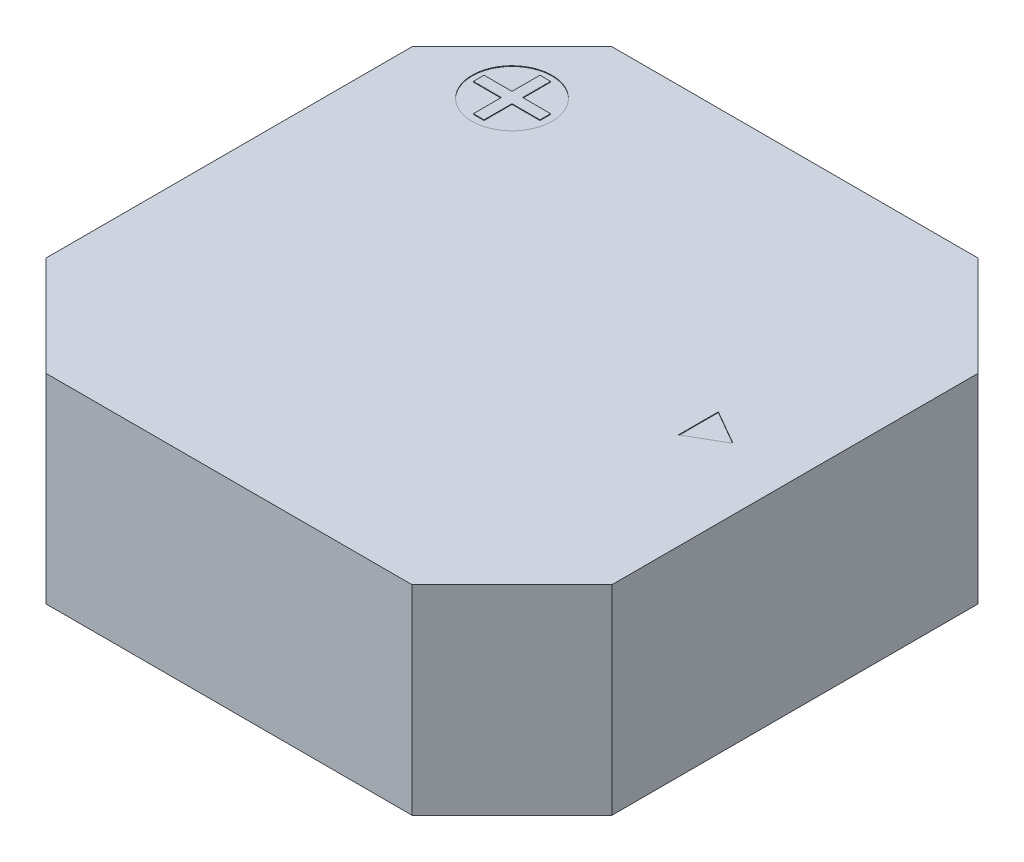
ISO-10303-21;
HEADER;
FILE_DESCRIPTION(('STEP AP214'),'2;1');
FILE_NAME('part.step','',(''),(''),'','','');
FILE_SCHEMA(('AUTOMOTIVE_DESIGN { 1 0 10303 214 1 1 1 1 }'));
ENDSEC;
DATA;
#1=APPLICATION_CONTEXT('core data for automotive mechanical design processes');
#2=APPLICATION_PROTOCOL_DEFINITION('international standard','automotive_design',2000,#1);
#3=PRODUCT_CONTEXT('',#1,'mechanical');
#4=PRODUCT('Part','Part','',(#3));
#5=PRODUCT_RELATED_PRODUCT_CATEGORY('part','',(#4));
#6=PRODUCT_DEFINITION_FORMATION('','',#4);
#7=PRODUCT_DEFINITION_CONTEXT('part definition',#1,'design');
#8=PRODUCT_DEFINITION('design','',#6,#7);
#9=PRODUCT_DEFINITION_SHAPE('','',#8);
#10=(LENGTH_UNIT() NAMED_UNIT(*) SI_UNIT(.MILLI.,.METRE.));
#11=(NAMED_UNIT(*) PLANE_ANGLE_UNIT() SI_UNIT($,.RADIAN.));
#12=(NAMED_UNIT(*) SI_UNIT($,.STERADIAN.) SOLID_ANGLE_UNIT());
#13=UNCERTAINTY_MEASURE_WITH_UNIT(LENGTH_MEASURE(1.E-05),#10,'distance_accuracy_value','');
#14=(GEOMETRIC_REPRESENTATION_CONTEXT(3) GLOBAL_UNCERTAINTY_ASSIGNED_CONTEXT((#13)) GLOBAL_UNIT_ASSIGNED_CONTEXT((#10,
#11,#12)) REPRESENTATION_CONTEXT('',''));
#15=CARTESIAN_POINT('',(0.,0.,0.));
#16=DIRECTION('',(0.,0.,1.));
#17=DIRECTION('',(1.,0.,0.));
#18=AXIS2_PLACEMENT_3D('',#15,#16,#17);
#19=CARTESIAN_POINT('',(-2.90842712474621,3.01,-3.32842712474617));
#20=DIRECTION('',(0.,0.,1.));
#21=DIRECTION('',(1.,0.,0.));
#22=AXIS2_PLACEMENT_3D('',#19,#20,#21);
#23=PLANE('',#22);
#24=DIRECTION('',(-1.,0.,0.));
#25=VECTOR('',#24,1.);
#26=CARTESIAN_POINT('',(-2.90842712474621,3.,-3.32842712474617));
#27=LINE('',#26,#25);
#28=CARTESIAN_POINT('',(-2.74842712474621,3.,-3.32842712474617));
#29=VERTEX_POINT('',#28);
#30=CARTESIAN_POINT('',(-2.90842712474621,3.,-3.32842712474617));
#31=VERTEX_POINT('',#30);
#32=EDGE_CURVE('E162',#29,#31,#27,.T.);
#33=ORIENTED_EDGE('',*,*,#32,.T.);
#34=DIRECTION('',(0.,-1.,0.));
#35=VECTOR('',#34,1.);
#36=CARTESIAN_POINT('',(-2.90842712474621,3.01,-3.32842712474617));
#37=LINE('',#36,#35);
#38=CARTESIAN_POINT('',(-2.90842712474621,3.01,-3.32842712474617));
#39=VERTEX_POINT('',#38);
#40=EDGE_CURVE('E12',#39,#31,#37,.T.);
#41=ORIENTED_EDGE('',*,*,#40,.F.);
#42=DIRECTION('',(-1.,0.,0.));
#43=VECTOR('',#42,1.);
#44=CARTESIAN_POINT('',(-2.90842712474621,3.01,-3.32842712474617));
#45=LINE('',#44,#43);
#46=CARTESIAN_POINT('',(-2.74842712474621,3.01,-3.32842712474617));
#47=VERTEX_POINT('',#46);
#48=EDGE_CURVE('E184',#47,#39,#45,.T.);
#49=ORIENTED_EDGE('',*,*,#48,.F.);
#50=DIRECTION('',(0.,-1.,0.));
#51=VECTOR('',#50,1.);
#52=CARTESIAN_POINT('',(-2.74842712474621,3.01,-3.32842712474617));
#53=LINE('',#52,#51);
#54=EDGE_CURVE('E158',#47,#29,#53,.T.);
#55=ORIENTED_EDGE('',*,*,#54,.T.);
#56=EDGE_LOOP('',(#33,#41,#49,#55));
#57=FACE_BOUND('',#56,.T.);
#58=ADVANCED_FACE('F42',(#57),#23,.F.);
#59=CARTESIAN_POINT('',(-2.90842712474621,3.01,-3.32842712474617));
#60=DIRECTION('',(1.,0.,0.));
#61=DIRECTION('',(0.,0.,-1.));
#62=AXIS2_PLACEMENT_3D('',#59,#60,#61);
#63=PLANE('',#62);
#64=DIRECTION('',(0.,0.,1.));
#65=VECTOR('',#64,1.);
#66=CARTESIAN_POINT('',(-2.90842712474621,3.,-3.32842712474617));
#67=LINE('',#66,#65);
#68=CARTESIAN_POINT('',(-2.90842712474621,3.,-2.90842712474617));
#69=VERTEX_POINT('',#68);
#70=EDGE_CURVE('E165',#31,#69,#67,.T.);
#71=ORIENTED_EDGE('',*,*,#70,.T.);
#72=DIRECTION('',(0.,-1.,0.));
#73=VECTOR('',#72,1.);
#74=CARTESIAN_POINT('',(-2.90842712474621,3.01,-2.90842712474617));
#75=LINE('',#74,#73);
#76=CARTESIAN_POINT('',(-2.90842712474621,3.01,-2.90842712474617));
#77=VERTEX_POINT('',#76);
#78=EDGE_CURVE('E50',#77,#69,#75,.T.);
#79=ORIENTED_EDGE('',*,*,#78,.F.);
#80=DIRECTION('',(0.,0.,1.));
#81=VECTOR('',#80,1.);
#82=CARTESIAN_POINT('',(-2.90842712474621,3.01,-3.32842712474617));
#83=LINE('',#82,#81);
#84=EDGE_CURVE('E113',#39,#77,#83,.T.);
#85=ORIENTED_EDGE('',*,*,#84,.F.);
#86=ORIENTED_EDGE('',*,*,#40,.T.);
#87=EDGE_LOOP('',(#71,#79,#85,#86));
#88=FACE_BOUND('',#87,.T.);
#89=ADVANCED_FACE('F262',(#88),#63,.F.);
#90=CARTESIAN_POINT('',(-2.90842712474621,3.01,-2.90842712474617));
#91=DIRECTION('',(0.,0.,1.));
#92=DIRECTION('',(1.,0.,0.));
#93=AXIS2_PLACEMENT_3D('',#90,#91,#92);
#94=PLANE('',#93);
#95=DIRECTION('',(-1.,0.,0.));
#96=VECTOR('',#95,1.);
#97=CARTESIAN_POINT('',(-2.90842712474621,3.,-2.90842712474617));
#98=LINE('',#97,#96);
#99=CARTESIAN_POINT('',(-3.32842712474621,3.,-2.90842712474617));
#100=VERTEX_POINT('',#99);
#101=EDGE_CURVE('E167',#69,#100,#98,.T.);
#102=ORIENTED_EDGE('',*,*,#101,.T.);
#103=DIRECTION('',(0.,-1.,0.));
#104=VECTOR('',#103,1.);
#105=CARTESIAN_POINT('',(-3.32842712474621,3.01,-2.90842712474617));
#106=LINE('',#105,#104);
#107=CARTESIAN_POINT('',(-3.32842712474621,3.01,-2.90842712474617));
#108=VERTEX_POINT('',#107);
#109=EDGE_CURVE('E203',#108,#100,#106,.T.);
#110=ORIENTED_EDGE('',*,*,#109,.F.);
#111=DIRECTION('',(-1.,0.,0.));
#112=VECTOR('',#111,1.);
#113=CARTESIAN_POINT('',(-2.90842712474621,3.01,-2.90842712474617));
#114=LINE('',#113,#112);
#115=EDGE_CURVE('E211',#77,#108,#114,.T.);
#116=ORIENTED_EDGE('',*,*,#115,.F.);
#117=ORIENTED_EDGE('',*,*,#78,.T.);
#118=EDGE_LOOP('',(#102,#110,#116,#117));
#119=FACE_BOUND('',#118,.T.);
#120=ADVANCED_FACE('F209',(#119),#94,.F.);
#121=CARTESIAN_POINT('',(-3.32842712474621,3.01,-2.90842712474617));
#122=DIRECTION('',(1.,0.,0.));
#123=DIRECTION('',(0.,0.,-1.));
#124=AXIS2_PLACEMENT_3D('',#121,#122,#123);
#125=PLANE('',#124);
#126=DIRECTION('',(0.,0.,1.));
#127=VECTOR('',#126,1.);
#128=CARTESIAN_POINT('',(-3.32842712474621,3.,-2.90842712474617));
#129=LINE('',#128,#127);
#130=CARTESIAN_POINT('',(-3.32842712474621,3.,-2.74842712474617));
#131=VERTEX_POINT('',#130);
#132=EDGE_CURVE('E169',#100,#131,#129,.T.);
#133=ORIENTED_EDGE('',*,*,#132,.T.);
#134=DIRECTION('',(0.,-1.,0.));
#135=VECTOR('',#134,1.);
#136=CARTESIAN_POINT('',(-3.32842712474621,3.01,-2.74842712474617));
#137=LINE('',#136,#135);
#138=CARTESIAN_POINT('',(-3.32842712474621,3.01,-2.74842712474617));
#139=VERTEX_POINT('',#138);
#140=EDGE_CURVE('E200',#139,#131,#137,.T.);
#141=ORIENTED_EDGE('',*,*,#140,.F.);
#142=DIRECTION('',(0.,0.,1.));
#143=VECTOR('',#142,1.);
#144=CARTESIAN_POINT('',(-3.32842712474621,3.01,-2.90842712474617));
#145=LINE('',#144,#143);
#146=EDGE_CURVE('E229',#108,#139,#145,.T.);
#147=ORIENTED_EDGE('',*,*,#146,.F.);
#148=ORIENTED_EDGE('',*,*,#109,.T.);
#149=EDGE_LOOP('',(#133,#141,#147,#148));
#150=FACE_BOUND('',#149,.T.);
#151=ADVANCED_FACE('F220',(#150),#125,.F.);
#152=CARTESIAN_POINT('',(-3.32842712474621,3.01,-2.74842712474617));
#153=DIRECTION('',(0.,0.,-1.));
#154=DIRECTION('',(-1.,0.,0.));
#155=AXIS2_PLACEMENT_3D('',#152,#153,#154);
#156=PLANE('',#155);
#157=DIRECTION('',(1.,0.,0.));
#158=VECTOR('',#157,1.);
#159=CARTESIAN_POINT('',(-3.32842712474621,3.,-2.74842712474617));
#160=LINE('',#159,#158);
#161=CARTESIAN_POINT('',(-2.90842712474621,3.,-2.74842712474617));
#162=VERTEX_POINT('',#161);
#163=EDGE_CURVE('E171',#131,#162,#160,.T.);
#164=ORIENTED_EDGE('',*,*,#163,.T.);
#165=DIRECTION('',(0.,-1.,0.));
#166=VECTOR('',#165,1.);
#167=CARTESIAN_POINT('',(-2.90842712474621,3.01,-2.74842712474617));
#168=LINE('',#167,#166);
#169=CARTESIAN_POINT('',(-2.90842712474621,3.01,-2.74842712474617));
#170=VERTEX_POINT('',#169);
#171=EDGE_CURVE('E197',#170,#162,#168,.T.);
#172=ORIENTED_EDGE('',*,*,#171,.F.);
#173=DIRECTION('',(1.,0.,0.));
#174=VECTOR('',#173,1.);
#175=CARTESIAN_POINT('',(-3.32842712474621,3.01,-2.74842712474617));
#176=LINE('',#175,#174);
#177=EDGE_CURVE('E226',#139,#170,#176,.T.);
#178=ORIENTED_EDGE('',*,*,#177,.F.);
#179=ORIENTED_EDGE('',*,*,#140,.T.);
#180=EDGE_LOOP('',(#164,#172,#178,#179));
#181=FACE_BOUND('',#180,.T.);
#182=ADVANCED_FACE('F224',(#181),#156,.F.);
#183=CARTESIAN_POINT('',(-2.90842712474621,3.01,-2.74842712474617));
#184=DIRECTION('',(1.,0.,0.));
#185=DIRECTION('',(0.,0.,-1.));
#186=AXIS2_PLACEMENT_3D('',#183,#184,#185);
#187=PLANE('',#186);
#188=DIRECTION('',(0.,0.,1.));
#189=VECTOR('',#188,1.);
#190=CARTESIAN_POINT('',(-2.90842712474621,3.,-2.74842712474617));
#191=LINE('',#190,#189);
#192=CARTESIAN_POINT('',(-2.90842712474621,3.,-2.32842712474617));
#193=VERTEX_POINT('',#192);
#194=EDGE_CURVE('E173',#162,#193,#191,.T.);
#195=ORIENTED_EDGE('',*,*,#194,.T.);
#196=DIRECTION('',(0.,-1.,0.));
#197=VECTOR('',#196,1.);
#198=CARTESIAN_POINT('',(-2.90842712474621,3.01,-2.32842712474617));
#199=LINE('',#198,#197);
#200=CARTESIAN_POINT('',(-2.90842712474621,3.01,-2.32842712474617));
#201=VERTEX_POINT('',#200);
#202=EDGE_CURVE('E194',#201,#193,#199,.T.);
#203=ORIENTED_EDGE('',*,*,#202,.F.);
#204=DIRECTION('',(0.,0.,1.));
#205=VECTOR('',#204,1.);
#206=CARTESIAN_POINT('',(-2.90842712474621,3.01,-2.74842712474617));
#207=LINE('',#206,#205);
#208=EDGE_CURVE('E228',#170,#201,#207,.T.);
#209=ORIENTED_EDGE('',*,*,#208,.F.);
#210=ORIENTED_EDGE('',*,*,#171,.T.);
#211=EDGE_LOOP('',(#195,#203,#209,#210));
#212=FACE_BOUND('',#211,.T.);
#213=ADVANCED_FACE('F275',(#212),#187,.F.);
#214=CARTESIAN_POINT('',(-2.90842712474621,3.01,-2.32842712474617));
#215=DIRECTION('',(0.,0.,-1.));
#216=DIRECTION('',(-1.,0.,0.));
#217=AXIS2_PLACEMENT_3D('',#214,#215,#216);
#218=PLANE('',#217);
#219=DIRECTION('',(1.,0.,0.));
#220=VECTOR('',#219,1.);
#221=CARTESIAN_POINT('',(-2.90842712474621,3.,-2.32842712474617));
#222=LINE('',#221,#220);
#223=CARTESIAN_POINT('',(-2.74842712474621,3.,-2.32842712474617));
#224=VERTEX_POINT('',#223);
#225=EDGE_CURVE('E175',#193,#224,#222,.T.);
#226=ORIENTED_EDGE('',*,*,#225,.T.);
#227=DIRECTION('',(0.,-1.,0.));
#228=VECTOR('',#227,1.);
#229=CARTESIAN_POINT('',(-2.74842712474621,3.01,-2.32842712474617));
#230=LINE('',#229,#228);
#231=CARTESIAN_POINT('',(-2.74842712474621,3.01,-2.32842712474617));
#232=VERTEX_POINT('',#231);
#233=EDGE_CURVE('E191',#232,#224,#230,.T.);
#234=ORIENTED_EDGE('',*,*,#233,.F.);
#235=DIRECTION('',(1.,0.,0.));
#236=VECTOR('',#235,1.);
#237=CARTESIAN_POINT('',(-2.90842712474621,3.01,-2.32842712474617));
#238=LINE('',#237,#236);
#239=EDGE_CURVE('E231',#201,#232,#238,.T.);
#240=ORIENTED_EDGE('',*,*,#239,.F.);
#241=ORIENTED_EDGE('',*,*,#202,.T.);
#242=EDGE_LOOP('',(#226,#234,#240,#241));
#243=FACE_BOUND('',#242,.T.);
#244=ADVANCED_FACE('F278',(#243),#218,.F.);
#245=CARTESIAN_POINT('',(-2.74842712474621,3.01,-2.74842712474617));
#246=DIRECTION('',(-1.,0.,0.));
#247=DIRECTION('',(0.,0.,1.));
#248=AXIS2_PLACEMENT_3D('',#245,#246,#247);
#249=PLANE('',#248);
#250=DIRECTION('',(0.,0.,-1.));
#251=VECTOR('',#250,1.);
#252=CARTESIAN_POINT('',(-2.74842712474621,3.,-2.74842712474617));
#253=LINE('',#252,#251);
#254=CARTESIAN_POINT('',(-2.74842712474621,3.,-2.74842712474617));
#255=VERTEX_POINT('',#254);
#256=EDGE_CURVE('E177',#224,#255,#253,.T.);
#257=ORIENTED_EDGE('',*,*,#256,.T.);
#258=DIRECTION('',(0.,-1.,0.));
#259=VECTOR('',#258,1.);
#260=CARTESIAN_POINT('',(-2.74842712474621,3.01,-2.74842712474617));
#261=LINE('',#260,#259);
#262=CARTESIAN_POINT('',(-2.74842712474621,3.01,-2.74842712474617));
#263=VERTEX_POINT('',#262);
#264=EDGE_CURVE('E188',#263,#255,#261,.T.);
#265=ORIENTED_EDGE('',*,*,#264,.F.);
#266=DIRECTION('',(0.,0.,-1.));
#267=VECTOR('',#266,1.);
#268=CARTESIAN_POINT('',(-2.74842712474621,3.01,-2.74842712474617));
#269=LINE('',#268,#267);
#270=EDGE_CURVE('E237',#232,#263,#269,.T.);
#271=ORIENTED_EDGE('',*,*,#270,.F.);
#272=ORIENTED_EDGE('',*,*,#233,.T.);
#273=EDGE_LOOP('',(#257,#265,#271,#272));
#274=FACE_BOUND('',#273,.T.);
#275=ADVANCED_FACE('F243',(#274),#249,.F.);
#276=CARTESIAN_POINT('',(-2.32842712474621,3.01,-2.74842712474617));
#277=DIRECTION('',(0.,0.,-1.));
#278=DIRECTION('',(-1.,0.,0.));
#279=AXIS2_PLACEMENT_3D('',#276,#277,#278);
#280=PLANE('',#279);
#281=DIRECTION('',(1.,0.,0.));
#282=VECTOR('',#281,1.);
#283=CARTESIAN_POINT('',(-2.32842712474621,3.,-2.74842712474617));
#284=LINE('',#283,#282);
#285=CARTESIAN_POINT('',(-2.32842712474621,3.,-2.74842712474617));
#286=VERTEX_POINT('',#285);
#287=EDGE_CURVE('E179',#255,#286,#284,.T.);
#288=ORIENTED_EDGE('',*,*,#287,.T.);
#289=DIRECTION('',(0.,-1.,0.));
#290=VECTOR('',#289,1.);
#291=CARTESIAN_POINT('',(-2.32842712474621,3.01,-2.74842712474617));
#292=LINE('',#291,#290);
#293=CARTESIAN_POINT('',(-2.32842712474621,3.01,-2.74842712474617));
#294=VERTEX_POINT('',#293);
#295=EDGE_CURVE('E153',#294,#286,#292,.T.);
#296=ORIENTED_EDGE('',*,*,#295,.F.);
#297=DIRECTION('',(1.,0.,0.));
#298=VECTOR('',#297,1.);
#299=CARTESIAN_POINT('',(-2.32842712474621,3.01,-2.74842712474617));
#300=LINE('',#299,#298);
#301=EDGE_CURVE('E144',#263,#294,#300,.T.);
#302=ORIENTED_EDGE('',*,*,#301,.F.);
#303=ORIENTED_EDGE('',*,*,#264,.T.);
#304=EDGE_LOOP('',(#288,#296,#302,#303));
#305=FACE_BOUND('',#304,.T.);
#306=ADVANCED_FACE('F247',(#305),#280,.F.);
#307=CARTESIAN_POINT('',(-2.32842712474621,3.01,-2.90842712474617));
#308=DIRECTION('',(-1.,0.,0.));
#309=DIRECTION('',(0.,0.,1.));
#310=AXIS2_PLACEMENT_3D('',#307,#308,#309);
#311=PLANE('',#310);
#312=DIRECTION('',(0.,0.,-1.));
#313=VECTOR('',#312,1.);
#314=CARTESIAN_POINT('',(-2.32842712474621,3.,-2.90842712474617));
#315=LINE('',#314,#313);
#316=CARTESIAN_POINT('',(-2.32842712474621,3.,-2.90842712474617));
#317=VERTEX_POINT('',#316);
#318=EDGE_CURVE('E152',#286,#317,#315,.T.);
#319=ORIENTED_EDGE('',*,*,#318,.T.);
#320=DIRECTION('',(0.,-1.,0.));
#321=VECTOR('',#320,1.);
#322=CARTESIAN_POINT('',(-2.32842712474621,3.01,-2.90842712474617));
#323=LINE('',#322,#321);
#324=CARTESIAN_POINT('',(-2.32842712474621,3.01,-2.90842712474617));
#325=VERTEX_POINT('',#324);
#326=EDGE_CURVE('E149',#325,#317,#323,.T.);
#327=ORIENTED_EDGE('',*,*,#326,.F.);
#328=DIRECTION('',(0.,0.,-1.));
#329=VECTOR('',#328,1.);
#330=CARTESIAN_POINT('',(-2.32842712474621,3.01,-2.90842712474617));
#331=LINE('',#330,#329);
#332=EDGE_CURVE('E138',#294,#325,#331,.T.);
#333=ORIENTED_EDGE('',*,*,#332,.F.);
#334=ORIENTED_EDGE('',*,*,#295,.T.);
#335=EDGE_LOOP('',(#319,#327,#333,#334));
#336=FACE_BOUND('',#335,.T.);
#337=ADVANCED_FACE('F150',(#336),#311,.F.);
#338=CARTESIAN_POINT('',(-2.74842712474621,3.01,-2.90842712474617));
#339=DIRECTION('',(0.,0.,1.));
#340=DIRECTION('',(1.,0.,0.));
#341=AXIS2_PLACEMENT_3D('',#338,#339,#340);
#342=PLANE('',#341);
#343=DIRECTION('',(-1.,0.,0.));
#344=VECTOR('',#343,1.);
#345=CARTESIAN_POINT('',(-2.74842712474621,3.,-2.90842712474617));
#346=LINE('',#345,#344);
#347=CARTESIAN_POINT('',(-2.74842712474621,3.,-2.90842712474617));
#348=VERTEX_POINT('',#347);
#349=EDGE_CURVE('E99',#317,#348,#346,.T.);
#350=ORIENTED_EDGE('',*,*,#349,.T.);
#351=DIRECTION('',(0.,-1.,0.));
#352=VECTOR('',#351,1.);
#353=CARTESIAN_POINT('',(-2.74842712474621,3.01,-2.90842712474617));
#354=LINE('',#353,#352);
#355=CARTESIAN_POINT('',(-2.74842712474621,3.01,-2.90842712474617));
#356=VERTEX_POINT('',#355);
#357=EDGE_CURVE('E154',#356,#348,#354,.T.);
#358=ORIENTED_EDGE('',*,*,#357,.F.);
#359=DIRECTION('',(-1.,0.,0.));
#360=VECTOR('',#359,1.);
#361=CARTESIAN_POINT('',(-2.74842712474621,3.01,-2.90842712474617));
#362=LINE('',#361,#360);
#363=EDGE_CURVE('E142',#325,#356,#362,.T.);
#364=ORIENTED_EDGE('',*,*,#363,.F.);
#365=ORIENTED_EDGE('',*,*,#326,.T.);
#366=EDGE_LOOP('',(#350,#358,#364,#365));
#367=FACE_BOUND('',#366,.T.);
#368=ADVANCED_FACE('F156',(#367),#342,.F.);
#369=CARTESIAN_POINT('',(-2.74842712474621,3.01,-3.32842712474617));
#370=DIRECTION('',(-1.,0.,0.));
#371=DIRECTION('',(0.,0.,1.));
#372=AXIS2_PLACEMENT_3D('',#369,#370,#371);
#373=PLANE('',#372);
#374=DIRECTION('',(0.,0.,-1.));
#375=VECTOR('',#374,1.);
#376=CARTESIAN_POINT('',(-2.74842712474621,3.,-3.32842712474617));
#377=LINE('',#376,#375);
#378=EDGE_CURVE('E105',#348,#29,#377,.T.);
#379=ORIENTED_EDGE('',*,*,#378,.T.);
#380=ORIENTED_EDGE('',*,*,#54,.F.);
#381=DIRECTION('',(0.,0.,-1.));
#382=VECTOR('',#381,1.);
#383=CARTESIAN_POINT('',(-2.74842712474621,3.01,-3.32842712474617));
#384=LINE('',#383,#382);
#385=EDGE_CURVE('E58',#356,#47,#384,.T.);
#386=ORIENTED_EDGE('',*,*,#385,.F.);
#387=ORIENTED_EDGE('',*,*,#357,.T.);
#388=EDGE_LOOP('',(#379,#380,#386,#387));
#389=FACE_BOUND('',#388,.T.);
#390=ADVANCED_FACE('F251',(#389),#373,.F.);
#391=CARTESIAN_POINT('',(0.,3.01,0.));
#392=DIRECTION('',(0.,-1.,0.));
#393=DIRECTION('',(0.,0.,-1.));
#394=AXIS2_PLACEMENT_3D('',#391,#392,#393);
#395=PLANE('',#394);
#396=ORIENTED_EDGE('',*,*,#48,.T.);
#397=ORIENTED_EDGE('',*,*,#84,.T.);
#398=ORIENTED_EDGE('',*,*,#115,.T.);
#399=ORIENTED_EDGE('',*,*,#146,.T.);
#400=ORIENTED_EDGE('',*,*,#177,.T.);
#401=ORIENTED_EDGE('',*,*,#208,.T.);
#402=ORIENTED_EDGE('',*,*,#239,.T.);
#403=ORIENTED_EDGE('',*,*,#270,.T.);
#404=ORIENTED_EDGE('',*,*,#301,.T.);
#405=ORIENTED_EDGE('',*,*,#332,.T.);
#406=ORIENTED_EDGE('',*,*,#363,.T.);
#407=ORIENTED_EDGE('',*,*,#385,.T.);
#408=EDGE_LOOP('',(#396,#397,#398,#399,#400,#401,#402,#403,#404,#405,#406,#407));
#409=FACE_BOUND('',#408,.T.);
#410=ADVANCED_FACE('F140',(#409),#395,.F.);
#411=CARTESIAN_POINT('',(0.,3.,0.));
#412=DIRECTION('',(0.,-1.,0.));
#413=DIRECTION('',(0.,0.,-1.));
#414=AXIS2_PLACEMENT_3D('',#411,#412,#413);
#415=PLANE('',#414);
#416=ORIENTED_EDGE('',*,*,#32,.F.);
#417=ORIENTED_EDGE('',*,*,#378,.F.);
#418=ORIENTED_EDGE('',*,*,#349,.F.);
#419=ORIENTED_EDGE('',*,*,#318,.F.);
#420=ORIENTED_EDGE('',*,*,#287,.F.);
#421=ORIENTED_EDGE('',*,*,#256,.F.);
#422=ORIENTED_EDGE('',*,*,#225,.F.);
#423=ORIENTED_EDGE('',*,*,#194,.F.);
#424=ORIENTED_EDGE('',*,*,#163,.F.);
#425=ORIENTED_EDGE('',*,*,#132,.F.);
#426=ORIENTED_EDGE('',*,*,#101,.F.);
#427=ORIENTED_EDGE('',*,*,#70,.F.);
#428=EDGE_LOOP('',(#416,#417,#418,#419,#420,#421,#422,#423,#424,#425,#426,#427));
#429=FACE_BOUND('',#428,.T.);
#430=ADVANCED_FACE('F215',(#429),#415,.T.);
#431=CLOSED_SHELL('',(#58,#89,#120,#151,#182,#213,#244,#275,#306,#337,#368,#390,#410,#430));
#432=MANIFOLD_SOLID_BREP('B2',#431);
#433=CARTESIAN_POINT('',(-4.25,3.,2.75));
#434=DIRECTION('',(1.,0.,0.));
#435=DIRECTION('',(0.,0.,-1.));
#436=AXIS2_PLACEMENT_3D('',#433,#434,#435);
#437=PLANE('',#436);
#438=DIRECTION('',(0.,0.,1.));
#439=VECTOR('',#438,1.);
#440=CARTESIAN_POINT('',(-4.25,0.,2.75));
#441=LINE('',#440,#439);
#442=CARTESIAN_POINT('',(-4.25,0.,-2.75));
#443=VERTEX_POINT('',#442);
#444=CARTESIAN_POINT('',(-4.25,0.,2.75));
#445=VERTEX_POINT('',#444);
#446=EDGE_CURVE('E481',#443,#445,#441,.T.);
#447=ORIENTED_EDGE('',*,*,#446,.T.);
#448=DIRECTION('',(0.,-1.,0.));
#449=VECTOR('',#448,1.);
#450=CARTESIAN_POINT('',(-4.25,3.,2.75));
#451=LINE('',#450,#449);
#452=CARTESIAN_POINT('',(-4.25,3.,2.75));
#453=VERTEX_POINT('',#452);
#454=EDGE_CURVE('E40',#453,#445,#451,.T.);
#455=ORIENTED_EDGE('',*,*,#454,.F.);
#456=DIRECTION('',(0.,0.,1.));
#457=VECTOR('',#456,1.);
#458=CARTESIAN_POINT('',(-4.25,3.,2.75));
#459=LINE('',#458,#457);
#460=CARTESIAN_POINT('',(-4.25,3.,-2.75));
#461=VERTEX_POINT('',#460);
#462=EDGE_CURVE('E497',#461,#453,#459,.T.);
#463=ORIENTED_EDGE('',*,*,#462,.F.);
#464=DIRECTION('',(0.,-1.,0.));
#465=VECTOR('',#464,1.);
#466=CARTESIAN_POINT('',(-4.25,3.,-2.75));
#467=LINE('',#466,#465);
#468=EDGE_CURVE('E477',#461,#443,#467,.T.);
#469=ORIENTED_EDGE('',*,*,#468,.T.);
#470=EDGE_LOOP('',(#447,#455,#463,#469));
#471=FACE_BOUND('',#470,.T.);
#472=ADVANCED_FACE('F373',(#471),#437,.F.);
#473=CARTESIAN_POINT('',(-4.25,3.,2.75));
#474=DIRECTION('',(0.707106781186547,0.,-0.707106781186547));
#475=DIRECTION('',(-0.707106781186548,0.,-0.707106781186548));
#476=AXIS2_PLACEMENT_3D('',#473,#474,#475);
#477=PLANE('',#476);
#478=DIRECTION('',(0.707106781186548,0.,0.707106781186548));
#479=VECTOR('',#478,1.);
#480=CARTESIAN_POINT('',(-4.25,0.,2.75));
#481=LINE('',#480,#479);
#482=CARTESIAN_POINT('',(-2.75,0.,4.25));
#483=VERTEX_POINT('',#482);
#484=EDGE_CURVE('E484',#445,#483,#481,.T.);
#485=ORIENTED_EDGE('',*,*,#484,.T.);
#486=DIRECTION('',(0.,-1.,0.));
#487=VECTOR('',#486,1.);
#488=CARTESIAN_POINT('',(-2.75,3.,4.25));
#489=LINE('',#488,#487);
#490=CARTESIAN_POINT('',(-2.75,3.,4.25));
#491=VERTEX_POINT('',#490);
#492=EDGE_CURVE('E380',#491,#483,#489,.T.);
#493=ORIENTED_EDGE('',*,*,#492,.F.);
#494=DIRECTION('',(0.707106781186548,0.,0.707106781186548));
#495=VECTOR('',#494,1.);
#496=CARTESIAN_POINT('',(-4.25,3.,2.75));
#497=LINE('',#496,#495);
#498=EDGE_CURVE('E437',#453,#491,#497,.T.);
#499=ORIENTED_EDGE('',*,*,#498,.F.);
#500=ORIENTED_EDGE('',*,*,#454,.T.);
#501=EDGE_LOOP('',(#485,#493,#499,#500));
#502=FACE_BOUND('',#501,.T.);
#503=ADVANCED_FACE('F601',(#502),#477,.F.);
#504=CARTESIAN_POINT('',(-2.75,3.,4.25));
#505=DIRECTION('',(0.,0.,-1.));
#506=DIRECTION('',(-1.,0.,0.));
#507=AXIS2_PLACEMENT_3D('',#504,#505,#506);
#508=PLANE('',#507);
#509=DIRECTION('',(1.,0.,0.));
#510=VECTOR('',#509,1.);
#511=CARTESIAN_POINT('',(-2.75,0.,4.25));
#512=LINE('',#511,#510);
#513=CARTESIAN_POINT('',(2.75,0.,4.25));
#514=VERTEX_POINT('',#513);
#515=EDGE_CURVE('E487',#483,#514,#512,.T.);
#516=ORIENTED_EDGE('',*,*,#515,.T.);
#517=DIRECTION('',(0.,-1.,0.));
#518=VECTOR('',#517,1.);
#519=CARTESIAN_POINT('',(2.75,3.,4.25));
#520=LINE('',#519,#518);
#521=CARTESIAN_POINT('',(2.75,3.,4.25));
#522=VERTEX_POINT('',#521);
#523=EDGE_CURVE('E504',#522,#514,#520,.T.);
#524=ORIENTED_EDGE('',*,*,#523,.F.);
#525=DIRECTION('',(1.,0.,0.));
#526=VECTOR('',#525,1.);
#527=CARTESIAN_POINT('',(-2.75,3.,4.25));
#528=LINE('',#527,#526);
#529=EDGE_CURVE('E512',#491,#522,#528,.T.);
#530=ORIENTED_EDGE('',*,*,#529,.F.);
#531=ORIENTED_EDGE('',*,*,#492,.T.);
#532=EDGE_LOOP('',(#516,#524,#530,#531));
#533=FACE_BOUND('',#532,.T.);
#534=ADVANCED_FACE('F510',(#533),#508,.F.);
#535=CARTESIAN_POINT('',(2.75,3.,4.25));
#536=DIRECTION('',(-0.707106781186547,0.,-0.707106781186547));
#537=DIRECTION('',(-0.707106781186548,0.,0.707106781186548));
#538=AXIS2_PLACEMENT_3D('',#535,#536,#537);
#539=PLANE('',#538);
#540=DIRECTION('',(0.707106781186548,0.,-0.707106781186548));
#541=VECTOR('',#540,1.);
#542=CARTESIAN_POINT('',(2.75,0.,4.25));
#543=LINE('',#542,#541);
#544=CARTESIAN_POINT('',(4.25,0.,2.75));
#545=VERTEX_POINT('',#544);
#546=EDGE_CURVE('E489',#514,#545,#543,.T.);
#547=ORIENTED_EDGE('',*,*,#546,.T.);
#548=DIRECTION('',(0.,-1.,0.));
#549=VECTOR('',#548,1.);
#550=CARTESIAN_POINT('',(4.25,3.,2.75));
#551=LINE('',#550,#549);
#552=CARTESIAN_POINT('',(4.25,3.,2.75));
#553=VERTEX_POINT('',#552);
#554=EDGE_CURVE('E501',#553,#545,#551,.T.);
#555=ORIENTED_EDGE('',*,*,#554,.F.);
#556=DIRECTION('',(0.707106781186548,0.,-0.707106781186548));
#557=VECTOR('',#556,1.);
#558=CARTESIAN_POINT('',(2.75,3.,4.25));
#559=LINE('',#558,#557);
#560=EDGE_CURVE('E524',#522,#553,#559,.T.);
#561=ORIENTED_EDGE('',*,*,#560,.F.);
#562=ORIENTED_EDGE('',*,*,#523,.T.);
#563=EDGE_LOOP('',(#547,#555,#561,#562));
#564=FACE_BOUND('',#563,.T.);
#565=ADVANCED_FACE('F520',(#564),#539,.F.);
#566=CARTESIAN_POINT('',(4.25,3.,2.75));
#567=DIRECTION('',(-1.,0.,0.));
#568=DIRECTION('',(0.,0.,1.));
#569=AXIS2_PLACEMENT_3D('',#566,#567,#568);
#570=PLANE('',#569);
#571=DIRECTION('',(0.,0.,-1.));
#572=VECTOR('',#571,1.);
#573=CARTESIAN_POINT('',(4.25,0.,2.75));
#574=LINE('',#573,#572);
#575=CARTESIAN_POINT('',(4.25,0.,-2.75));
#576=VERTEX_POINT('',#575);
#577=EDGE_CURVE('E491',#545,#576,#574,.T.);
#578=ORIENTED_EDGE('',*,*,#577,.T.);
#579=DIRECTION('',(0.,-1.,0.));
#580=VECTOR('',#579,1.);
#581=CARTESIAN_POINT('',(4.25,3.,-2.75));
#582=LINE('',#581,#580);
#583=CARTESIAN_POINT('',(4.25,3.,-2.75));
#584=VERTEX_POINT('',#583);
#585=EDGE_CURVE('E472',#584,#576,#582,.T.);
#586=ORIENTED_EDGE('',*,*,#585,.F.);
#587=DIRECTION('',(0.,0.,-1.));
#588=VECTOR('',#587,1.);
#589=CARTESIAN_POINT('',(4.25,3.,2.75));
#590=LINE('',#589,#588);
#591=EDGE_CURVE('E460',#553,#584,#590,.T.);
#592=ORIENTED_EDGE('',*,*,#591,.F.);
#593=ORIENTED_EDGE('',*,*,#554,.T.);
#594=EDGE_LOOP('',(#578,#586,#592,#593));
#595=FACE_BOUND('',#594,.T.);
#596=ADVANCED_FACE('F523',(#595),#570,.F.);
#597=CARTESIAN_POINT('',(2.75,3.,-4.25));
#598=DIRECTION('',(-0.707106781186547,0.,0.707106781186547));
#599=DIRECTION('',(0.707106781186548,0.,0.707106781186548));
#600=AXIS2_PLACEMENT_3D('',#597,#598,#599);
#601=PLANE('',#600);
#602=DIRECTION('',(-0.707106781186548,0.,-0.707106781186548));
#603=VECTOR('',#602,1.);
#604=CARTESIAN_POINT('',(2.75,0.,-4.25));
#605=LINE('',#604,#603);
#606=CARTESIAN_POINT('',(2.75,0.,-4.25));
#607=VERTEX_POINT('',#606);
#608=EDGE_CURVE('E469',#576,#607,#605,.T.);
#609=ORIENTED_EDGE('',*,*,#608,.T.);
#610=DIRECTION('',(0.,-1.,0.));
#611=VECTOR('',#610,1.);
#612=CARTESIAN_POINT('',(2.75,3.,-4.25));
#613=LINE('',#612,#611);
#614=CARTESIAN_POINT('',(2.75,3.,-4.25));
#615=VERTEX_POINT('',#614);
#616=EDGE_CURVE('E466',#615,#607,#613,.T.);
#617=ORIENTED_EDGE('',*,*,#616,.F.);
#618=DIRECTION('',(-0.707106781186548,0.,-0.707106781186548));
#619=VECTOR('',#618,1.);
#620=CARTESIAN_POINT('',(2.75,3.,-4.25));
#621=LINE('',#620,#619);
#622=EDGE_CURVE('E453',#584,#615,#621,.T.);
#623=ORIENTED_EDGE('',*,*,#622,.F.);
#624=ORIENTED_EDGE('',*,*,#585,.T.);
#625=EDGE_LOOP('',(#609,#617,#623,#624));
#626=FACE_BOUND('',#625,.T.);
#627=ADVANCED_FACE('F467',(#626),#601,.F.);
#628=CARTESIAN_POINT('',(-2.75,3.,-4.25));
#629=DIRECTION('',(0.,0.,1.));
#630=DIRECTION('',(1.,0.,0.));
#631=AXIS2_PLACEMENT_3D('',#628,#629,#630);
#632=PLANE('',#631);
#633=DIRECTION('',(-1.,0.,0.));
#634=VECTOR('',#633,1.);
#635=CARTESIAN_POINT('',(-2.75,0.,-4.25));
#636=LINE('',#635,#634);
#637=CARTESIAN_POINT('',(-2.75,0.,-4.25));
#638=VERTEX_POINT('',#637);
#639=EDGE_CURVE('E494',#607,#638,#636,.T.);
#640=ORIENTED_EDGE('',*,*,#639,.T.);
#641=DIRECTION('',(0.,-1.,0.));
#642=VECTOR('',#641,1.);
#643=CARTESIAN_POINT('',(-2.75,3.,-4.25));
#644=LINE('',#643,#642);
#645=CARTESIAN_POINT('',(-2.75,3.,-4.25));
#646=VERTEX_POINT('',#645);
#647=EDGE_CURVE('E473',#646,#638,#644,.T.);
#648=ORIENTED_EDGE('',*,*,#647,.F.);
#649=DIRECTION('',(-1.,0.,0.));
#650=VECTOR('',#649,1.);
#651=CARTESIAN_POINT('',(-2.75,3.,-4.25));
#652=LINE('',#651,#650);
#653=EDGE_CURVE('E457',#615,#646,#652,.T.);
#654=ORIENTED_EDGE('',*,*,#653,.F.);
#655=ORIENTED_EDGE('',*,*,#616,.T.);
#656=EDGE_LOOP('',(#640,#648,#654,#655));
#657=FACE_BOUND('',#656,.T.);
#658=ADVANCED_FACE('F475',(#657),#632,.F.);
#659=CARTESIAN_POINT('',(-4.25,3.,-2.75));
#660=DIRECTION('',(0.707106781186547,0.,0.707106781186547));
#661=DIRECTION('',(0.707106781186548,0.,-0.707106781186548));
#662=AXIS2_PLACEMENT_3D('',#659,#660,#661);
#663=PLANE('',#662);
#664=DIRECTION('',(-0.707106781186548,0.,0.707106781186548));
#665=VECTOR('',#664,1.);
#666=CARTESIAN_POINT('',(-4.25,0.,-2.75));
#667=LINE('',#666,#665);
#668=EDGE_CURVE('E429',#638,#443,#667,.T.);
#669=ORIENTED_EDGE('',*,*,#668,.T.);
#670=ORIENTED_EDGE('',*,*,#468,.F.);
#671=DIRECTION('',(-0.707106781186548,0.,0.707106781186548));
#672=VECTOR('',#671,1.);
#673=CARTESIAN_POINT('',(-4.25,3.,-2.75));
#674=LINE('',#673,#672);
#675=EDGE_CURVE('E396',#646,#461,#674,.T.);
#676=ORIENTED_EDGE('',*,*,#675,.F.);
#677=ORIENTED_EDGE('',*,*,#647,.T.);
#678=EDGE_LOOP('',(#669,#670,#676,#677));
#679=FACE_BOUND('',#678,.T.);
#680=ADVANCED_FACE('F570',(#679),#663,.F.);
#681=CARTESIAN_POINT('',(0.,3.,0.));
#682=DIRECTION('',(0.,-1.,0.));
#683=DIRECTION('',(0.,0.,-1.));
#684=AXIS2_PLACEMENT_3D('',#681,#682,#683);
#685=PLANE('',#684);
#686=CARTESIAN_POINT('',(-2.82842712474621,3.,-2.82842712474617));
#687=DIRECTION('',(0.,1.,0.));
#688=DIRECTION('',(0.,0.,1.));
#689=AXIS2_PLACEMENT_3D('',#686,#687,#688);
#690=CIRCLE('',#689,0.6);
#691=CARTESIAN_POINT('',(-2.82842712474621,3.,-2.22842712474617));
#692=VERTEX_POINT('',#691);
#693=EDGE_CURVE('E553',#692,#692,#690,.T.);
#694=ORIENTED_EDGE('',*,*,#693,.F.);
#695=EDGE_LOOP('',(#694));
#696=FACE_BOUND('',#695,.T.);
#697=DIRECTION('',(0.,0.,1.));
#698=VECTOR('',#697,1.);
#699=CARTESIAN_POINT('',(2.8,3.,-0.3));
#700=LINE('',#699,#698);
#701=CARTESIAN_POINT('',(2.8,3.,-0.3));
#702=VERTEX_POINT('',#701);
#703=CARTESIAN_POINT('',(2.8,3.,0.3));
#704=VERTEX_POINT('',#703);
#705=EDGE_CURVE('E541',#702,#704,#700,.T.);
#706=ORIENTED_EDGE('',*,*,#705,.F.);
#707=DIRECTION('',(-0.866025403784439,0.,-0.5));
#708=VECTOR('',#707,1.);
#709=CARTESIAN_POINT('',(3.31961524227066,3.,0.));
#710=LINE('',#709,#708);
#711=CARTESIAN_POINT('',(3.31961524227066,3.,0.));
#712=VERTEX_POINT('',#711);
#713=EDGE_CURVE('E387',#712,#702,#710,.T.);
#714=ORIENTED_EDGE('',*,*,#713,.F.);
#715=DIRECTION('',(0.866025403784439,0.,-0.5));
#716=VECTOR('',#715,1.);
#717=CARTESIAN_POINT('',(2.8,3.,0.3));
#718=LINE('',#717,#716);
#719=EDGE_CURVE('E537',#704,#712,#718,.T.);
#720=ORIENTED_EDGE('',*,*,#719,.F.);
#721=EDGE_LOOP('',(#706,#714,#720));
#722=FACE_BOUND('',#721,.T.);
#723=ORIENTED_EDGE('',*,*,#462,.T.);
#724=ORIENTED_EDGE('',*,*,#498,.T.);
#725=ORIENTED_EDGE('',*,*,#529,.T.);
#726=ORIENTED_EDGE('',*,*,#560,.T.);
#727=ORIENTED_EDGE('',*,*,#591,.T.);
#728=ORIENTED_EDGE('',*,*,#622,.T.);
#729=ORIENTED_EDGE('',*,*,#653,.T.);
#730=ORIENTED_EDGE('',*,*,#675,.T.);
#731=EDGE_LOOP('',(#723,#724,#725,#726,#727,#728,#729,#730));
#732=FACE_BOUND('',#731,.T.);
#733=ADVANCED_FACE('F455',(#696,#722,#732),#685,.F.);
#734=CARTESIAN_POINT('',(0.,0.,0.));
#735=DIRECTION('',(0.,-1.,0.));
#736=DIRECTION('',(0.,0.,-1.));
#737=AXIS2_PLACEMENT_3D('',#734,#735,#736);
#738=PLANE('',#737);
#739=ORIENTED_EDGE('',*,*,#446,.F.);
#740=ORIENTED_EDGE('',*,*,#668,.F.);
#741=ORIENTED_EDGE('',*,*,#639,.F.);
#742=ORIENTED_EDGE('',*,*,#608,.F.);
#743=ORIENTED_EDGE('',*,*,#577,.F.);
#744=ORIENTED_EDGE('',*,*,#546,.F.);
#745=ORIENTED_EDGE('',*,*,#515,.F.);
#746=ORIENTED_EDGE('',*,*,#484,.F.);
#747=EDGE_LOOP('',(#739,#740,#741,#742,#743,#744,#745,#746));
#748=FACE_BOUND('',#747,.T.);
#749=ADVANCED_FACE('F516',(#748),#738,.T.);
#750=CARTESIAN_POINT('',(3.31961524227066,2.99,0.));
#751=DIRECTION('',(0.5,0.,-0.866025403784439));
#752=DIRECTION('',(-0.866025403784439,0.,-0.5));
#753=AXIS2_PLACEMENT_3D('',#750,#751,#752);
#754=PLANE('',#753);
#755=ORIENTED_EDGE('',*,*,#713,.T.);
#756=DIRECTION('',(0.,1.,0.));
#757=VECTOR('',#756,1.);
#758=CARTESIAN_POINT('',(2.8,2.99,-0.3));
#759=LINE('',#758,#757);
#760=CARTESIAN_POINT('',(2.8,2.99,-0.3));
#761=VERTEX_POINT('',#760);
#762=EDGE_CURVE('E530',#761,#702,#759,.T.);
#763=ORIENTED_EDGE('',*,*,#762,.F.);
#764=DIRECTION('',(-0.866025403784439,0.,-0.5));
#765=VECTOR('',#764,1.);
#766=CARTESIAN_POINT('',(3.31961524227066,2.99,0.));
#767=LINE('',#766,#765);
#768=CARTESIAN_POINT('',(3.31961524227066,2.99,0.));
#769=VERTEX_POINT('',#768);
#770=EDGE_CURVE('E540',#769,#761,#767,.T.);
#771=ORIENTED_EDGE('',*,*,#770,.F.);
#772=DIRECTION('',(0.,1.,0.));
#773=VECTOR('',#772,1.);
#774=CARTESIAN_POINT('',(3.31961524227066,2.99,0.));
#775=LINE('',#774,#773);
#776=EDGE_CURVE('E485',#769,#712,#775,.T.);
#777=ORIENTED_EDGE('',*,*,#776,.T.);
#778=EDGE_LOOP('',(#755,#763,#771,#777));
#779=FACE_BOUND('',#778,.T.);
#780=ADVANCED_FACE('F588',(#779),#754,.F.);
#781=CARTESIAN_POINT('',(2.8,2.99,0.3));
#782=DIRECTION('',(0.5,0.,0.866025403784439));
#783=DIRECTION('',(0.866025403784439,0.,-0.5));
#784=AXIS2_PLACEMENT_3D('',#781,#782,#783);
#785=PLANE('',#784);
#786=ORIENTED_EDGE('',*,*,#719,.T.);
#787=ORIENTED_EDGE('',*,*,#776,.F.);
#788=DIRECTION('',(0.866025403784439,0.,-0.5));
#789=VECTOR('',#788,1.);
#790=CARTESIAN_POINT('',(2.8,2.99,0.3));
#791=LINE('',#790,#789);
#792=CARTESIAN_POINT('',(2.8,2.99,0.3));
#793=VERTEX_POINT('',#792);
#794=EDGE_CURVE('E533',#793,#769,#791,.T.);
#795=ORIENTED_EDGE('',*,*,#794,.F.);
#796=DIRECTION('',(0.,1.,0.));
#797=VECTOR('',#796,1.);
#798=CARTESIAN_POINT('',(2.8,2.99,0.3));
#799=LINE('',#798,#797);
#800=EDGE_CURVE('E532',#793,#704,#799,.T.);
#801=ORIENTED_EDGE('',*,*,#800,.T.);
#802=EDGE_LOOP('',(#786,#787,#795,#801));
#803=FACE_BOUND('',#802,.T.);
#804=ADVANCED_FACE('F590',(#803),#785,.F.);
#805=CARTESIAN_POINT('',(2.8,2.99,-0.3));
#806=DIRECTION('',(-1.,0.,0.));
#807=DIRECTION('',(0.,0.,1.));
#808=AXIS2_PLACEMENT_3D('',#805,#806,#807);
#809=PLANE('',#808);
#810=ORIENTED_EDGE('',*,*,#705,.T.);
#811=ORIENTED_EDGE('',*,*,#800,.F.);
#812=DIRECTION('',(0.,0.,1.));
#813=VECTOR('',#812,1.);
#814=CARTESIAN_POINT('',(2.8,2.99,-0.3));
#815=LINE('',#814,#813);
#816=EDGE_CURVE('E548',#761,#793,#815,.T.);
#817=ORIENTED_EDGE('',*,*,#816,.F.);
#818=ORIENTED_EDGE('',*,*,#762,.T.);
#819=EDGE_LOOP('',(#810,#811,#817,#818));
#820=FACE_BOUND('',#819,.T.);
#821=ADVANCED_FACE('F577',(#820),#809,.F.);
#822=CARTESIAN_POINT('',(0.,2.99,0.));
#823=DIRECTION('',(0.,1.,0.));
#824=DIRECTION('',(0.,0.,1.));
#825=AXIS2_PLACEMENT_3D('',#822,#823,#824);
#826=PLANE('',#825);
#827=ORIENTED_EDGE('',*,*,#770,.T.);
#828=ORIENTED_EDGE('',*,*,#816,.T.);
#829=ORIENTED_EDGE('',*,*,#794,.T.);
#830=EDGE_LOOP('',(#827,#828,#829));
#831=FACE_BOUND('',#830,.T.);
#832=ADVANCED_FACE('F564',(#831),#826,.T.);
#833=CARTESIAN_POINT('',(-2.82842712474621,2.99,-2.82842712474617));
#834=DIRECTION('',(0.,1.,0.));
#835=DIRECTION('',(0.,0.,1.));
#836=AXIS2_PLACEMENT_3D('',#833,#834,#835);
#837=CYLINDRICAL_SURFACE('',#836,0.6);
#838=CARTESIAN_POINT('',(-2.82842712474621,2.99,-2.82842712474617));
#839=DIRECTION('',(0.,1.,0.));
#840=DIRECTION('',(0.,0.,1.));
#841=AXIS2_PLACEMENT_3D('',#838,#839,#840);
#842=CIRCLE('',#841,0.6);
#843=CARTESIAN_POINT('',(-2.82842712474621,2.99,-2.22842712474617));
#844=VERTEX_POINT('',#843);
#845=EDGE_CURVE('E545',#844,#844,#842,.T.);
#846=ORIENTED_EDGE('',*,*,#845,.F.);
#847=EDGE_LOOP('',(#846));
#848=FACE_BOUND('',#847,.T.);
#849=ORIENTED_EDGE('',*,*,#693,.T.);
#850=EDGE_LOOP('',(#849));
#851=FACE_BOUND('',#850,.T.);
#852=ADVANCED_FACE('F561',(#848,#851),#837,.F.);
#853=CARTESIAN_POINT('',(-2.82842712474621,2.99,-2.82842712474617));
#854=DIRECTION('',(0.,1.,0.));
#855=DIRECTION('',(0.,0.,1.));
#856=AXIS2_PLACEMENT_3D('',#853,#854,#855);
#857=PLANE('',#856);
#858=ORIENTED_EDGE('',*,*,#845,.T.);
#859=EDGE_LOOP('',(#858));
#860=FACE_BOUND('',#859,.T.);
#861=ADVANCED_FACE('F559',(#860),#857,.T.);
#862=CLOSED_SHELL('',(#472,#503,#534,#565,#596,#627,#658,#680,#733,#749,#780,#804,#821,#832,
#852,#861));
#863=MANIFOLD_SOLID_BREP('B6',#862);
#864=ADVANCED_BREP_SHAPE_REPRESENTATION('',(#18,#432,#863),#14);
#865=SHAPE_DEFINITION_REPRESENTATION(#9,#864);
ENDSEC;
END-ISO-10303-21;
